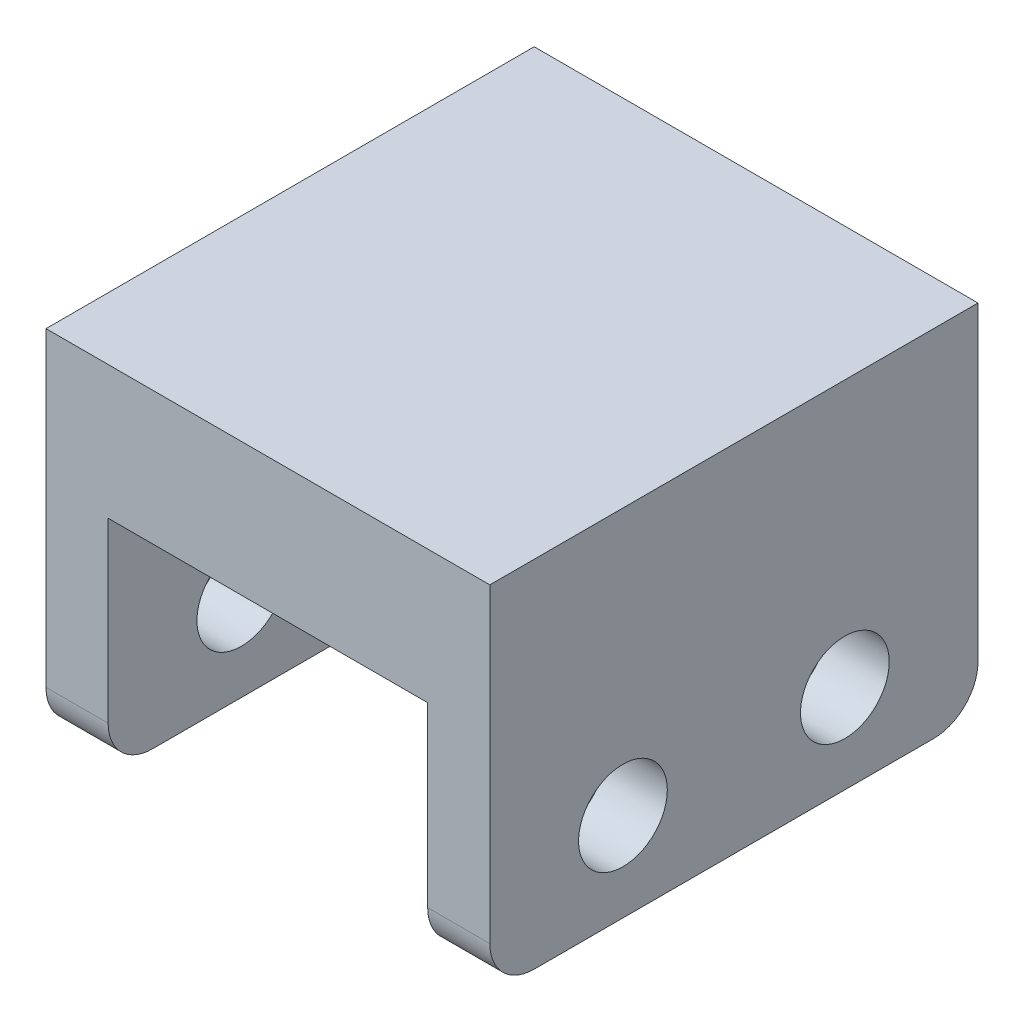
ISO-10303-21;
HEADER;
FILE_DESCRIPTION(('STEP AP214'),'2;1');
FILE_NAME('part.step','',(''),(''),'','','');
FILE_SCHEMA(('AUTOMOTIVE_DESIGN { 1 0 10303 214 1 1 1 1 }'));
ENDSEC;
DATA;
#1=APPLICATION_CONTEXT('core data for automotive mechanical design processes');
#2=APPLICATION_PROTOCOL_DEFINITION('international standard','automotive_design',2000,#1);
#3=PRODUCT_CONTEXT('',#1,'mechanical');
#4=PRODUCT('Part','Part','',(#3));
#5=PRODUCT_RELATED_PRODUCT_CATEGORY('part','',(#4));
#6=PRODUCT_DEFINITION_FORMATION('','',#4);
#7=PRODUCT_DEFINITION_CONTEXT('part definition',#1,'design');
#8=PRODUCT_DEFINITION('design','',#6,#7);
#9=PRODUCT_DEFINITION_SHAPE('','',#8);
#10=(LENGTH_UNIT() NAMED_UNIT(*) SI_UNIT(.MILLI.,.METRE.));
#11=(NAMED_UNIT(*) PLANE_ANGLE_UNIT() SI_UNIT($,.RADIAN.));
#12=(NAMED_UNIT(*) SI_UNIT($,.STERADIAN.) SOLID_ANGLE_UNIT());
#13=UNCERTAINTY_MEASURE_WITH_UNIT(LENGTH_MEASURE(1.E-05),#10,'distance_accuracy_value','');
#14=(GEOMETRIC_REPRESENTATION_CONTEXT(3) GLOBAL_UNCERTAINTY_ASSIGNED_CONTEXT((#13)) GLOBAL_UNIT_ASSIGNED_CONTEXT((#10,
#11,#12)) REPRESENTATION_CONTEXT('',''));
#15=CARTESIAN_POINT('',(0.,0.,0.));
#16=DIRECTION('',(0.,0.,1.));
#17=DIRECTION('',(1.,0.,0.));
#18=AXIS2_PLACEMENT_3D('',#15,#16,#17);
#19=CARTESIAN_POINT('',(0.,0.,0.));
#20=DIRECTION('',(0.,1.,0.));
#21=DIRECTION('',(0.,0.,1.));
#22=AXIS2_PLACEMENT_3D('',#19,#20,#21);
#23=PLANE('',#22);
#24=DIRECTION('',(1.,0.,0.));
#25=VECTOR('',#24,1.);
#26=CARTESIAN_POINT('',(0.,0.,22.5));
#27=LINE('',#26,#25);
#28=CARTESIAN_POINT('',(25.,0.,22.5));
#29=VERTEX_POINT('',#28);
#30=CARTESIAN_POINT('',(18.,0.,22.5));
#31=VERTEX_POINT('',#30);
#32=EDGE_CURVE('E204',#29,#31,#27,.F.);
#33=ORIENTED_EDGE('',*,*,#32,.T.);
#34=DIRECTION('',(0.,0.,1.));
#35=VECTOR('',#34,1.);
#36=CARTESIAN_POINT('',(18.,0.,-27.5));
#37=LINE('',#36,#35);
#38=CARTESIAN_POINT('',(18.,0.,-22.5));
#39=VERTEX_POINT('',#38);
#40=EDGE_CURVE('E154',#39,#31,#37,.T.);
#41=ORIENTED_EDGE('',*,*,#40,.F.);
#42=DIRECTION('',(-1.,0.,0.));
#43=VECTOR('',#42,1.);
#44=CARTESIAN_POINT('',(0.,0.,-22.5));
#45=LINE('',#44,#43);
#46=CARTESIAN_POINT('',(25.,0.,-22.5));
#47=VERTEX_POINT('',#46);
#48=EDGE_CURVE('E207',#39,#47,#45,.F.);
#49=ORIENTED_EDGE('',*,*,#48,.T.);
#50=DIRECTION('',(0.,0.,-1.));
#51=VECTOR('',#50,1.);
#52=CARTESIAN_POINT('',(25.,0.,-27.5));
#53=LINE('',#52,#51);
#54=EDGE_CURVE('E168',#29,#47,#53,.T.);
#55=ORIENTED_EDGE('',*,*,#54,.F.);
#56=EDGE_LOOP('',(#33,#41,#49,#55));
#57=FACE_BOUND('',#56,.T.);
#58=ADVANCED_FACE('F38',(#57),#23,.F.);
#59=CARTESIAN_POINT('',(-25.,5.,-22.5));
#60=DIRECTION('',(-1.,0.,0.));
#61=DIRECTION('',(0.,0.,1.));
#62=AXIS2_PLACEMENT_3D('',#59,#60,#61);
#63=CYLINDRICAL_SURFACE('',#62,5.);
#64=CARTESIAN_POINT('',(18.,5.,-22.5));
#65=DIRECTION('',(1.,0.,0.));
#66=DIRECTION('',(0.,0.,-1.));
#67=AXIS2_PLACEMENT_3D('',#64,#65,#66);
#68=CIRCLE('',#67,5.);
#69=CARTESIAN_POINT('',(18.,5.,-27.5));
#70=VERTEX_POINT('',#69);
#71=EDGE_CURVE('E166',#70,#39,#68,.F.);
#72=ORIENTED_EDGE('',*,*,#71,.F.);
#73=DIRECTION('',(-1.,0.,0.));
#74=VECTOR('',#73,1.);
#75=CARTESIAN_POINT('',(-25.,5.,-27.5));
#76=LINE('',#75,#74);
#77=CARTESIAN_POINT('',(25.,5.,-27.5));
#78=VERTEX_POINT('',#77);
#79=EDGE_CURVE('E196',#78,#70,#76,.T.);
#80=ORIENTED_EDGE('',*,*,#79,.F.);
#81=CARTESIAN_POINT('',(25.,5.,-22.5));
#82=DIRECTION('',(-1.,0.,0.));
#83=DIRECTION('',(0.,0.,1.));
#84=AXIS2_PLACEMENT_3D('',#81,#82,#83);
#85=CIRCLE('',#84,5.);
#86=EDGE_CURVE('E213',#47,#78,#85,.F.);
#87=ORIENTED_EDGE('',*,*,#86,.F.);
#88=ORIENTED_EDGE('',*,*,#48,.F.);
#89=EDGE_LOOP('',(#72,#80,#87,#88));
#90=FACE_BOUND('',#89,.T.);
#91=ADVANCED_FACE('F255',(#90),#63,.T.);
#92=CARTESIAN_POINT('',(-25.,5.,22.5));
#93=DIRECTION('',(1.,0.,0.));
#94=DIRECTION('',(0.,0.,-1.));
#95=AXIS2_PLACEMENT_3D('',#92,#93,#94);
#96=CYLINDRICAL_SURFACE('',#95,5.);
#97=CARTESIAN_POINT('',(18.,5.,22.5));
#98=DIRECTION('',(1.,0.,0.));
#99=DIRECTION('',(0.,0.,-1.));
#100=AXIS2_PLACEMENT_3D('',#97,#98,#99);
#101=CIRCLE('',#100,5.);
#102=CARTESIAN_POINT('',(18.,5.,27.5));
#103=VERTEX_POINT('',#102);
#104=EDGE_CURVE('E12',#31,#103,#101,.F.);
#105=ORIENTED_EDGE('',*,*,#104,.F.);
#106=ORIENTED_EDGE('',*,*,#32,.F.);
#107=CARTESIAN_POINT('',(25.,5.,22.5));
#108=DIRECTION('',(-1.,0.,0.));
#109=DIRECTION('',(0.,0.,1.));
#110=AXIS2_PLACEMENT_3D('',#107,#108,#109);
#111=CIRCLE('',#110,5.);
#112=CARTESIAN_POINT('',(25.,5.,27.5));
#113=VERTEX_POINT('',#112);
#114=EDGE_CURVE('E211',#113,#29,#111,.F.);
#115=ORIENTED_EDGE('',*,*,#114,.F.);
#116=DIRECTION('',(1.,0.,0.));
#117=VECTOR('',#116,1.);
#118=CARTESIAN_POINT('',(-25.,5.,27.5));
#119=LINE('',#118,#117);
#120=EDGE_CURVE('E63',#103,#113,#119,.T.);
#121=ORIENTED_EDGE('',*,*,#120,.F.);
#122=EDGE_LOOP('',(#105,#106,#115,#121));
#123=FACE_BOUND('',#122,.T.);
#124=ADVANCED_FACE('F263',(#123),#96,.T.);
#125=CARTESIAN_POINT('',(25.,40.,-27.5));
#126=DIRECTION('',(-1.,0.,0.));
#127=DIRECTION('',(0.,0.,1.));
#128=AXIS2_PLACEMENT_3D('',#125,#126,#127);
#129=PLANE('',#128);
#130=CARTESIAN_POINT('',(25.,10.,-12.5));
#131=DIRECTION('',(1.,0.,0.));
#132=DIRECTION('',(0.,0.,-1.));
#133=AXIS2_PLACEMENT_3D('',#130,#131,#132);
#134=CIRCLE('',#133,5.);
#135=CARTESIAN_POINT('',(25.,10.,-17.5));
#136=VERTEX_POINT('',#135);
#137=EDGE_CURVE('E336',#136,#136,#134,.T.);
#138=ORIENTED_EDGE('',*,*,#137,.F.);
#139=EDGE_LOOP('',(#138));
#140=FACE_BOUND('',#139,.T.);
#141=CARTESIAN_POINT('',(25.,10.,12.5));
#142=DIRECTION('',(1.,0.,0.));
#143=DIRECTION('',(0.,0.,-1.));
#144=AXIS2_PLACEMENT_3D('',#141,#142,#143);
#145=CIRCLE('',#144,5.);
#146=CARTESIAN_POINT('',(25.,10.,7.49999999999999));
#147=VERTEX_POINT('',#146);
#148=EDGE_CURVE('E220',#147,#147,#145,.T.);
#149=ORIENTED_EDGE('',*,*,#148,.F.);
#150=EDGE_LOOP('',(#149));
#151=FACE_BOUND('',#150,.T.);
#152=ORIENTED_EDGE('',*,*,#54,.T.);
#153=ORIENTED_EDGE('',*,*,#86,.T.);
#154=DIRECTION('',(0.,-1.,0.));
#155=VECTOR('',#154,1.);
#156=CARTESIAN_POINT('',(25.,40.,-27.5));
#157=LINE('',#156,#155);
#158=CARTESIAN_POINT('',(25.,40.,-27.5));
#159=VERTEX_POINT('',#158);
#160=EDGE_CURVE('E192',#159,#78,#157,.T.);
#161=ORIENTED_EDGE('',*,*,#160,.F.);
#162=DIRECTION('',(0.,0.,-1.));
#163=VECTOR('',#162,1.);
#164=CARTESIAN_POINT('',(25.,40.,-27.5));
#165=LINE('',#164,#163);
#166=CARTESIAN_POINT('',(25.,40.,27.5));
#167=VERTEX_POINT('',#166);
#168=EDGE_CURVE('E169',#167,#159,#165,.T.);
#169=ORIENTED_EDGE('',*,*,#168,.F.);
#170=DIRECTION('',(0.,-1.,0.));
#171=VECTOR('',#170,1.);
#172=CARTESIAN_POINT('',(25.,40.,27.5));
#173=LINE('',#172,#171);
#174=EDGE_CURVE('E179',#167,#113,#173,.T.);
#175=ORIENTED_EDGE('',*,*,#174,.T.);
#176=ORIENTED_EDGE('',*,*,#114,.T.);
#177=EDGE_LOOP('',(#152,#153,#161,#169,#175,#176));
#178=FACE_BOUND('',#177,.T.);
#179=ADVANCED_FACE('F295',(#140,#151,#178),#129,.F.);
#180=CARTESIAN_POINT('',(-25.,40.,-27.5));
#181=DIRECTION('',(0.,0.,1.));
#182=DIRECTION('',(1.,0.,0.));
#183=AXIS2_PLACEMENT_3D('',#180,#181,#182);
#184=PLANE('',#183);
#185=ORIENTED_EDGE('',*,*,#79,.T.);
#186=DIRECTION('',(0.,-1.,0.));
#187=VECTOR('',#186,1.);
#188=CARTESIAN_POINT('',(18.,25.,-27.5));
#189=LINE('',#188,#187);
#190=CARTESIAN_POINT('',(18.,25.,-27.5));
#191=VERTEX_POINT('',#190);
#192=EDGE_CURVE('E158',#191,#70,#189,.T.);
#193=ORIENTED_EDGE('',*,*,#192,.F.);
#194=DIRECTION('',(1.,0.,0.));
#195=VECTOR('',#194,1.);
#196=CARTESIAN_POINT('',(-18.,25.,-27.5));
#197=LINE('',#196,#195);
#198=CARTESIAN_POINT('',(-18.,25.,-27.5));
#199=VERTEX_POINT('',#198);
#200=EDGE_CURVE('E135',#199,#191,#197,.T.);
#201=ORIENTED_EDGE('',*,*,#200,.F.);
#202=DIRECTION('',(0.,-1.,0.));
#203=VECTOR('',#202,1.);
#204=CARTESIAN_POINT('',(-18.,25.,-27.5));
#205=LINE('',#204,#203);
#206=CARTESIAN_POINT('',(-18.,5.,-27.5));
#207=VERTEX_POINT('',#206);
#208=EDGE_CURVE('E161',#199,#207,#205,.T.);
#209=ORIENTED_EDGE('',*,*,#208,.T.);
#210=CARTESIAN_POINT('',(-25.,5.,-27.5));
#211=VERTEX_POINT('',#210);
#212=EDGE_CURVE('E195',#207,#211,#76,.T.);
#213=ORIENTED_EDGE('',*,*,#212,.T.);
#214=DIRECTION('',(0.,-1.,0.));
#215=VECTOR('',#214,1.);
#216=CARTESIAN_POINT('',(-25.,40.,-27.5));
#217=LINE('',#216,#215);
#218=CARTESIAN_POINT('',(-25.,40.,-27.5));
#219=VERTEX_POINT('',#218);
#220=EDGE_CURVE('E189',#219,#211,#217,.T.);
#221=ORIENTED_EDGE('',*,*,#220,.F.);
#222=DIRECTION('',(-1.,0.,0.));
#223=VECTOR('',#222,1.);
#224=CARTESIAN_POINT('',(-25.,40.,-27.5));
#225=LINE('',#224,#223);
#226=EDGE_CURVE('E172',#159,#219,#225,.T.);
#227=ORIENTED_EDGE('',*,*,#226,.F.);
#228=ORIENTED_EDGE('',*,*,#160,.T.);
#229=EDGE_LOOP('',(#185,#193,#201,#209,#213,#221,#227,#228));
#230=FACE_BOUND('',#229,.T.);
#231=ADVANCED_FACE('F285',(#230),#184,.F.);
#232=CARTESIAN_POINT('',(-25.,40.,-27.5));
#233=DIRECTION('',(1.,0.,0.));
#234=DIRECTION('',(0.,0.,-1.));
#235=AXIS2_PLACEMENT_3D('',#232,#233,#234);
#236=PLANE('',#235);
#237=CARTESIAN_POINT('',(-25.,10.,-12.5));
#238=DIRECTION('',(1.,0.,0.));
#239=DIRECTION('',(0.,0.,-1.));
#240=AXIS2_PLACEMENT_3D('',#237,#238,#239);
#241=CIRCLE('',#240,5.);
#242=CARTESIAN_POINT('',(-25.,10.,-17.5));
#243=VERTEX_POINT('',#242);
#244=EDGE_CURVE('E226',#243,#243,#241,.T.);
#245=ORIENTED_EDGE('',*,*,#244,.T.);
#246=EDGE_LOOP('',(#245));
#247=FACE_BOUND('',#246,.T.);
#248=CARTESIAN_POINT('',(-25.,10.,12.5));
#249=DIRECTION('',(1.,0.,0.));
#250=DIRECTION('',(0.,0.,-1.));
#251=AXIS2_PLACEMENT_3D('',#248,#249,#250);
#252=CIRCLE('',#251,5.);
#253=CARTESIAN_POINT('',(-25.,10.,7.49999999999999));
#254=VERTEX_POINT('',#253);
#255=EDGE_CURVE('E156',#254,#254,#252,.T.);
#256=ORIENTED_EDGE('',*,*,#255,.T.);
#257=EDGE_LOOP('',(#256));
#258=FACE_BOUND('',#257,.T.);
#259=ORIENTED_EDGE('',*,*,#220,.T.);
#260=CARTESIAN_POINT('',(-25.,5.,-22.5));
#261=DIRECTION('',(1.,0.,0.));
#262=DIRECTION('',(0.,0.,-1.));
#263=AXIS2_PLACEMENT_3D('',#260,#261,#262);
#264=CIRCLE('',#263,5.);
#265=CARTESIAN_POINT('',(-25.,0.,-22.5));
#266=VERTEX_POINT('',#265);
#267=EDGE_CURVE('E201',#211,#266,#264,.F.);
#268=ORIENTED_EDGE('',*,*,#267,.T.);
#269=DIRECTION('',(0.,0.,1.));
#270=VECTOR('',#269,1.);
#271=CARTESIAN_POINT('',(-25.,0.,-27.5));
#272=LINE('',#271,#270);
#273=CARTESIAN_POINT('',(-25.,0.,22.5));
#274=VERTEX_POINT('',#273);
#275=EDGE_CURVE('E173',#266,#274,#272,.T.);
#276=ORIENTED_EDGE('',*,*,#275,.T.);
#277=CARTESIAN_POINT('',(-25.,5.,22.5));
#278=DIRECTION('',(1.,0.,0.));
#279=DIRECTION('',(0.,0.,-1.));
#280=AXIS2_PLACEMENT_3D('',#277,#278,#279);
#281=CIRCLE('',#280,5.);
#282=CARTESIAN_POINT('',(-25.,5.,27.5));
#283=VERTEX_POINT('',#282);
#284=EDGE_CURVE('E199',#274,#283,#281,.F.);
#285=ORIENTED_EDGE('',*,*,#284,.T.);
#286=DIRECTION('',(0.,-1.,0.));
#287=VECTOR('',#286,1.);
#288=CARTESIAN_POINT('',(-25.,40.,27.5));
#289=LINE('',#288,#287);
#290=CARTESIAN_POINT('',(-25.,40.,27.5));
#291=VERTEX_POINT('',#290);
#292=EDGE_CURVE('E186',#291,#283,#289,.T.);
#293=ORIENTED_EDGE('',*,*,#292,.F.);
#294=DIRECTION('',(0.,0.,1.));
#295=VECTOR('',#294,1.);
#296=CARTESIAN_POINT('',(-25.,40.,-27.5));
#297=LINE('',#296,#295);
#298=EDGE_CURVE('E175',#219,#291,#297,.T.);
#299=ORIENTED_EDGE('',*,*,#298,.F.);
#300=EDGE_LOOP('',(#259,#268,#276,#285,#293,#299));
#301=FACE_BOUND('',#300,.T.);
#302=ADVANCED_FACE('F237',(#247,#258,#301),#236,.F.);
#303=CARTESIAN_POINT('',(-25.,40.,27.5));
#304=DIRECTION('',(0.,0.,-1.));
#305=DIRECTION('',(-1.,0.,0.));
#306=AXIS2_PLACEMENT_3D('',#303,#304,#305);
#307=PLANE('',#306);
#308=DIRECTION('',(-1.,0.,0.));
#309=VECTOR('',#308,1.);
#310=CARTESIAN_POINT('',(-18.,25.,27.5));
#311=LINE('',#310,#309);
#312=CARTESIAN_POINT('',(18.,25.,27.5));
#313=VERTEX_POINT('',#312);
#314=CARTESIAN_POINT('',(-18.,25.,27.5));
#315=VERTEX_POINT('',#314);
#316=EDGE_CURVE('E141',#313,#315,#311,.T.);
#317=ORIENTED_EDGE('',*,*,#316,.F.);
#318=DIRECTION('',(0.,-1.,0.));
#319=VECTOR('',#318,1.);
#320=CARTESIAN_POINT('',(18.,25.,27.5));
#321=LINE('',#320,#319);
#322=EDGE_CURVE('E128',#313,#103,#321,.T.);
#323=ORIENTED_EDGE('',*,*,#322,.T.);
#324=ORIENTED_EDGE('',*,*,#120,.T.);
#325=ORIENTED_EDGE('',*,*,#174,.F.);
#326=DIRECTION('',(1.,0.,0.));
#327=VECTOR('',#326,1.);
#328=CARTESIAN_POINT('',(-25.,40.,27.5));
#329=LINE('',#328,#327);
#330=EDGE_CURVE('E177',#291,#167,#329,.T.);
#331=ORIENTED_EDGE('',*,*,#330,.F.);
#332=ORIENTED_EDGE('',*,*,#292,.T.);
#333=CARTESIAN_POINT('',(-18.,5.,27.5));
#334=VERTEX_POINT('',#333);
#335=EDGE_CURVE('E215',#283,#334,#119,.T.);
#336=ORIENTED_EDGE('',*,*,#335,.T.);
#337=DIRECTION('',(0.,-1.,0.));
#338=VECTOR('',#337,1.);
#339=CARTESIAN_POINT('',(-18.,25.,27.5));
#340=LINE('',#339,#338);
#341=EDGE_CURVE('E55',#315,#334,#340,.T.);
#342=ORIENTED_EDGE('',*,*,#341,.F.);
#343=EDGE_LOOP('',(#317,#323,#324,#325,#331,#332,#336,#342));
#344=FACE_BOUND('',#343,.T.);
#345=ADVANCED_FACE('F146',(#344),#307,.F.);
#346=CARTESIAN_POINT('',(0.,40.,0.));
#347=DIRECTION('',(0.,1.,0.));
#348=DIRECTION('',(0.,0.,1.));
#349=AXIS2_PLACEMENT_3D('',#346,#347,#348);
#350=PLANE('',#349);
#351=ORIENTED_EDGE('',*,*,#168,.T.);
#352=ORIENTED_EDGE('',*,*,#226,.T.);
#353=ORIENTED_EDGE('',*,*,#298,.T.);
#354=ORIENTED_EDGE('',*,*,#330,.T.);
#355=EDGE_LOOP('',(#351,#352,#353,#354));
#356=FACE_BOUND('',#355,.T.);
#357=ADVANCED_FACE('F269',(#356),#350,.T.);
#358=CARTESIAN_POINT('',(-18.,0.,-22.5));
#359=VERTEX_POINT('',#358);
#360=EDGE_CURVE('E208',#266,#359,#45,.F.);
#361=ORIENTED_EDGE('',*,*,#360,.T.);
#362=DIRECTION('',(0.,0.,-1.));
#363=VECTOR('',#362,1.);
#364=CARTESIAN_POINT('',(-18.,0.,-27.5));
#365=LINE('',#364,#363);
#366=CARTESIAN_POINT('',(-18.,0.,22.5));
#367=VERTEX_POINT('',#366);
#368=EDGE_CURVE('E144',#367,#359,#365,.T.);
#369=ORIENTED_EDGE('',*,*,#368,.F.);
#370=EDGE_CURVE('E203',#367,#274,#27,.F.);
#371=ORIENTED_EDGE('',*,*,#370,.T.);
#372=ORIENTED_EDGE('',*,*,#275,.F.);
#373=EDGE_LOOP('',(#361,#369,#371,#372));
#374=FACE_BOUND('',#373,.T.);
#375=ADVANCED_FACE('F258',(#374),#23,.F.);
#376=CARTESIAN_POINT('',(-18.,5.,-22.5));
#377=DIRECTION('',(-1.,0.,0.));
#378=DIRECTION('',(0.,0.,1.));
#379=AXIS2_PLACEMENT_3D('',#376,#377,#378);
#380=CIRCLE('',#379,5.);
#381=EDGE_CURVE('E160',#359,#207,#380,.F.);
#382=ORIENTED_EDGE('',*,*,#381,.F.);
#383=ORIENTED_EDGE('',*,*,#360,.F.);
#384=ORIENTED_EDGE('',*,*,#267,.F.);
#385=ORIENTED_EDGE('',*,*,#212,.F.);
#386=EDGE_LOOP('',(#382,#383,#384,#385));
#387=FACE_BOUND('',#386,.T.);
#388=ADVANCED_FACE('F265',(#387),#63,.T.);
#389=CARTESIAN_POINT('',(-18.,5.,22.5));
#390=DIRECTION('',(-1.,0.,0.));
#391=DIRECTION('',(0.,0.,1.));
#392=AXIS2_PLACEMENT_3D('',#389,#390,#391);
#393=CIRCLE('',#392,5.);
#394=EDGE_CURVE('E47',#334,#367,#393,.F.);
#395=ORIENTED_EDGE('',*,*,#394,.F.);
#396=ORIENTED_EDGE('',*,*,#335,.F.);
#397=ORIENTED_EDGE('',*,*,#284,.F.);
#398=ORIENTED_EDGE('',*,*,#370,.F.);
#399=EDGE_LOOP('',(#395,#396,#397,#398));
#400=FACE_BOUND('',#399,.T.);
#401=ADVANCED_FACE('F40',(#400),#96,.T.);
#402=CARTESIAN_POINT('',(18.,25.,-27.5));
#403=DIRECTION('',(1.,0.,0.));
#404=DIRECTION('',(0.,0.,-1.));
#405=AXIS2_PLACEMENT_3D('',#402,#403,#404);
#406=PLANE('',#405);
#407=CARTESIAN_POINT('',(18.,10.,-12.5));
#408=DIRECTION('',(1.,0.,0.));
#409=DIRECTION('',(0.,0.,-1.));
#410=AXIS2_PLACEMENT_3D('',#407,#408,#409);
#411=CIRCLE('',#410,5.);
#412=CARTESIAN_POINT('',(18.,10.,-17.5));
#413=VERTEX_POINT('',#412);
#414=EDGE_CURVE('E231',#413,#413,#411,.T.);
#415=ORIENTED_EDGE('',*,*,#414,.T.);
#416=EDGE_LOOP('',(#415));
#417=FACE_BOUND('',#416,.T.);
#418=CARTESIAN_POINT('',(18.,10.,12.5));
#419=DIRECTION('',(1.,0.,0.));
#420=DIRECTION('',(0.,0.,-1.));
#421=AXIS2_PLACEMENT_3D('',#418,#419,#420);
#422=CIRCLE('',#421,5.);
#423=CARTESIAN_POINT('',(18.,10.,7.49999999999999));
#424=VERTEX_POINT('',#423);
#425=EDGE_CURVE('E219',#424,#424,#422,.T.);
#426=ORIENTED_EDGE('',*,*,#425,.T.);
#427=EDGE_LOOP('',(#426));
#428=FACE_BOUND('',#427,.T.);
#429=ORIENTED_EDGE('',*,*,#71,.T.);
#430=ORIENTED_EDGE('',*,*,#40,.T.);
#431=ORIENTED_EDGE('',*,*,#104,.T.);
#432=ORIENTED_EDGE('',*,*,#322,.F.);
#433=DIRECTION('',(0.,0.,1.));
#434=VECTOR('',#433,1.);
#435=CARTESIAN_POINT('',(18.,25.,-27.5));
#436=LINE('',#435,#434);
#437=EDGE_CURVE('E131',#191,#313,#436,.T.);
#438=ORIENTED_EDGE('',*,*,#437,.F.);
#439=ORIENTED_EDGE('',*,*,#192,.T.);
#440=EDGE_LOOP('',(#429,#430,#431,#432,#438,#439));
#441=FACE_BOUND('',#440,.T.);
#442=ADVANCED_FACE('F130',(#417,#428,#441),#406,.F.);
#443=CARTESIAN_POINT('',(-18.,25.,-27.5));
#444=DIRECTION('',(-1.,0.,0.));
#445=DIRECTION('',(0.,0.,1.));
#446=AXIS2_PLACEMENT_3D('',#443,#444,#445);
#447=PLANE('',#446);
#448=CARTESIAN_POINT('',(-18.,10.,-12.5));
#449=DIRECTION('',(-1.,0.,0.));
#450=DIRECTION('',(0.,0.,1.));
#451=AXIS2_PLACEMENT_3D('',#448,#449,#450);
#452=CIRCLE('',#451,5.);
#453=CARTESIAN_POINT('',(-18.,10.,-17.5));
#454=VERTEX_POINT('',#453);
#455=EDGE_CURVE('E42',#454,#454,#452,.T.);
#456=ORIENTED_EDGE('',*,*,#455,.T.);
#457=EDGE_LOOP('',(#456));
#458=FACE_BOUND('',#457,.T.);
#459=CARTESIAN_POINT('',(-18.,10.,12.5));
#460=DIRECTION('',(-1.,0.,0.));
#461=DIRECTION('',(0.,0.,1.));
#462=AXIS2_PLACEMENT_3D('',#459,#460,#461);
#463=CIRCLE('',#462,5.);
#464=CARTESIAN_POINT('',(-18.,10.,7.49999999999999));
#465=VERTEX_POINT('',#464);
#466=EDGE_CURVE('E217',#465,#465,#463,.T.);
#467=ORIENTED_EDGE('',*,*,#466,.T.);
#468=EDGE_LOOP('',(#467));
#469=FACE_BOUND('',#468,.T.);
#470=ORIENTED_EDGE('',*,*,#381,.T.);
#471=ORIENTED_EDGE('',*,*,#208,.F.);
#472=DIRECTION('',(0.,0.,-1.));
#473=VECTOR('',#472,1.);
#474=CARTESIAN_POINT('',(-18.,25.,-27.5));
#475=LINE('',#474,#473);
#476=EDGE_CURVE('E148',#315,#199,#475,.T.);
#477=ORIENTED_EDGE('',*,*,#476,.F.);
#478=ORIENTED_EDGE('',*,*,#341,.T.);
#479=ORIENTED_EDGE('',*,*,#394,.T.);
#480=ORIENTED_EDGE('',*,*,#368,.T.);
#481=EDGE_LOOP('',(#470,#471,#477,#478,#479,#480));
#482=FACE_BOUND('',#481,.T.);
#483=ADVANCED_FACE('F251',(#458,#469,#482),#447,.F.);
#484=CARTESIAN_POINT('',(0.,25.,0.));
#485=DIRECTION('',(0.,1.,0.));
#486=DIRECTION('',(0.,0.,1.));
#487=AXIS2_PLACEMENT_3D('',#484,#485,#486);
#488=PLANE('',#487);
#489=ORIENTED_EDGE('',*,*,#437,.T.);
#490=ORIENTED_EDGE('',*,*,#316,.T.);
#491=ORIENTED_EDGE('',*,*,#476,.T.);
#492=ORIENTED_EDGE('',*,*,#200,.T.);
#493=EDGE_LOOP('',(#489,#490,#491,#492));
#494=FACE_BOUND('',#493,.T.);
#495=ADVANCED_FACE('F139',(#494),#488,.F.);
#496=CARTESIAN_POINT('',(-36.,10.,12.5));
#497=DIRECTION('',(1.,0.,0.));
#498=DIRECTION('',(0.,0.,-1.));
#499=AXIS2_PLACEMENT_3D('',#496,#497,#498);
#500=CYLINDRICAL_SURFACE('',#499,5.);
#501=CARTESIAN_POINT('',(-18.,10.,7.49999999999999));
#502=CARTESIAN_POINT('',(-18.0729166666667,10.,7.49999999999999));
#503=CARTESIAN_POINT('',(-18.1458333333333,10.,7.49999999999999));
#504=CARTESIAN_POINT('',(-18.2916666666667,10.,7.49999999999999));
#505=CARTESIAN_POINT('',(-18.3645833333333,10.,7.49999999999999));
#506=CARTESIAN_POINT('',(-18.5104166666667,10.,7.49999999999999));
#507=CARTESIAN_POINT('',(-18.5833333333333,10.,7.49999999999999));
#508=CARTESIAN_POINT('',(-18.7291666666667,10.,7.49999999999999));
#509=CARTESIAN_POINT('',(-18.8020833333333,10.,7.49999999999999));
#510=CARTESIAN_POINT('',(-18.9479166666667,10.,7.49999999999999));
#511=CARTESIAN_POINT('',(-19.0208333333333,10.,7.49999999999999));
#512=CARTESIAN_POINT('',(-19.1666666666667,10.,7.49999999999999));
#513=CARTESIAN_POINT('',(-19.2395833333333,10.,7.49999999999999));
#514=CARTESIAN_POINT('',(-19.3854166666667,10.,7.49999999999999));
#515=CARTESIAN_POINT('',(-19.4583333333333,10.,7.49999999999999));
#516=CARTESIAN_POINT('',(-19.6041666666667,10.,7.49999999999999));
#517=CARTESIAN_POINT('',(-19.6770833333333,10.,7.49999999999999));
#518=CARTESIAN_POINT('',(-19.8229166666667,10.,7.49999999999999));
#519=CARTESIAN_POINT('',(-19.8958333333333,10.,7.49999999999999));
#520=CARTESIAN_POINT('',(-20.0416666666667,10.,7.49999999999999));
#521=CARTESIAN_POINT('',(-20.1145833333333,10.,7.49999999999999));
#522=CARTESIAN_POINT('',(-20.2604166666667,10.,7.49999999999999));
#523=CARTESIAN_POINT('',(-20.3333333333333,10.,7.49999999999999));
#524=CARTESIAN_POINT('',(-20.4791666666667,10.,7.49999999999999));
#525=CARTESIAN_POINT('',(-20.5520833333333,10.,7.49999999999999));
#526=CARTESIAN_POINT('',(-20.6979166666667,10.,7.49999999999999));
#527=CARTESIAN_POINT('',(-20.7708333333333,10.,7.49999999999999));
#528=CARTESIAN_POINT('',(-20.9166666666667,10.,7.49999999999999));
#529=CARTESIAN_POINT('',(-20.9895833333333,10.,7.49999999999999));
#530=CARTESIAN_POINT('',(-21.1354166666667,10.,7.49999999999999));
#531=CARTESIAN_POINT('',(-21.2083333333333,10.,7.49999999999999));
#532=CARTESIAN_POINT('',(-21.3541666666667,10.,7.49999999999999));
#533=CARTESIAN_POINT('',(-21.4270833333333,10.,7.49999999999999));
#534=CARTESIAN_POINT('',(-21.5729166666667,10.,7.49999999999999));
#535=CARTESIAN_POINT('',(-21.6458333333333,10.,7.49999999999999));
#536=CARTESIAN_POINT('',(-21.7916666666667,10.,7.49999999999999));
#537=CARTESIAN_POINT('',(-21.8645833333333,10.,7.49999999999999));
#538=CARTESIAN_POINT('',(-22.0104166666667,10.,7.49999999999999));
#539=CARTESIAN_POINT('',(-22.0833333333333,10.,7.49999999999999));
#540=CARTESIAN_POINT('',(-22.2291666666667,10.,7.49999999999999));
#541=CARTESIAN_POINT('',(-22.3020833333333,10.,7.49999999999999));
#542=CARTESIAN_POINT('',(-22.4479166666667,10.,7.49999999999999));
#543=CARTESIAN_POINT('',(-22.5208333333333,10.,7.49999999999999));
#544=CARTESIAN_POINT('',(-22.6666666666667,10.,7.49999999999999));
#545=CARTESIAN_POINT('',(-22.7395833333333,10.,7.49999999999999));
#546=CARTESIAN_POINT('',(-22.8854166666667,10.,7.49999999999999));
#547=CARTESIAN_POINT('',(-22.9583333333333,10.,7.49999999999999));
#548=CARTESIAN_POINT('',(-23.1041666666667,10.,7.49999999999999));
#549=CARTESIAN_POINT('',(-23.1770833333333,10.,7.49999999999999));
#550=CARTESIAN_POINT('',(-23.3229166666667,10.,7.49999999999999));
#551=CARTESIAN_POINT('',(-23.3958333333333,10.,7.49999999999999));
#552=CARTESIAN_POINT('',(-23.5416666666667,10.,7.49999999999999));
#553=CARTESIAN_POINT('',(-23.6145833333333,10.,7.49999999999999));
#554=CARTESIAN_POINT('',(-23.7604166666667,10.,7.49999999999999));
#555=CARTESIAN_POINT('',(-23.8333333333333,10.,7.49999999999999));
#556=CARTESIAN_POINT('',(-23.9791666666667,10.,7.49999999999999));
#557=CARTESIAN_POINT('',(-24.0520833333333,10.,7.49999999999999));
#558=CARTESIAN_POINT('',(-24.1979166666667,10.,7.49999999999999));
#559=CARTESIAN_POINT('',(-24.2708333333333,10.,7.49999999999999));
#560=CARTESIAN_POINT('',(-24.4166666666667,10.,7.49999999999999));
#561=CARTESIAN_POINT('',(-24.4895833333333,10.,7.49999999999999));
#562=CARTESIAN_POINT('',(-24.6354166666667,10.,7.49999999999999));
#563=CARTESIAN_POINT('',(-24.7083333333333,10.,7.49999999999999));
#564=CARTESIAN_POINT('',(-24.8541666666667,10.,7.49999999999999));
#565=CARTESIAN_POINT('',(-24.9270833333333,10.,7.49999999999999));
#566=CARTESIAN_POINT('',(-25.,10.,7.49999999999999));
#567=B_SPLINE_CURVE_WITH_KNOTS('',3,(#501,#502,#503,#504,#505,#506,#507,#508,#509,#510,#511,
#512,#513,#514,#515,#516,#517,#518,#519,#520,#521,#522,#523,#524,#525,#526,#527,#528,#529,#530,
#531,#532,#533,#534,#535,#536,#537,#538,#539,#540,#541,#542,#543,#544,#545,#546,#547,#548,#549,
#550,#551,#552,#553,#554,#555,#556,#557,#558,#559,#560,#561,#562,#563,#564,#565,#566),
.UNSPECIFIED.,.F.,.F.,(4,2,2,2,2,2,2,2,2,2,2,2,2,2,2,2,2,2,2,2,2,2,2,2,2,2,2,2,2,2,2,2,4),(0.,
0.21875,0.4375,0.656250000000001,0.875000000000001,1.09375,1.3125,1.53125,1.75,1.96875,2.1875,
2.40625,2.625,2.84375,3.0625,3.28125,3.5,3.71875,3.9375,4.15625,4.375,4.59375,4.8125,5.03125,
5.25,5.46875,5.6875,5.90625000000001,6.125,6.34375000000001,6.5625,6.78125000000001,7.),.UNSPECIFIED.);
#568=EDGE_CURVE('BSEAM240',#465,#254,#567,.T.);
#569=ORIENTED_EDGE('',*,*,#466,.F.);
#570=ORIENTED_EDGE('',*,*,#255,.F.);
#571=ORIENTED_EDGE('',*,*,#568,.T.);
#572=ORIENTED_EDGE('',*,*,#568,.F.);
#573=EDGE_LOOP('',(#569,#571,#570,#572));
#574=FACE_BOUND('',#573,.T.);
#575=ADVANCED_FACE('F240',(#574),#500,.F.);
#576=CARTESIAN_POINT('',(25.,10.,7.49999999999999));
#577=CARTESIAN_POINT('',(24.9270833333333,10.,7.49999999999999));
#578=CARTESIAN_POINT('',(24.8541666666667,10.,7.49999999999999));
#579=CARTESIAN_POINT('',(24.7083333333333,10.,7.49999999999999));
#580=CARTESIAN_POINT('',(24.6354166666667,10.,7.49999999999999));
#581=CARTESIAN_POINT('',(24.4895833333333,10.,7.49999999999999));
#582=CARTESIAN_POINT('',(24.4166666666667,10.,7.49999999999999));
#583=CARTESIAN_POINT('',(24.2708333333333,10.,7.49999999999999));
#584=CARTESIAN_POINT('',(24.1979166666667,10.,7.49999999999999));
#585=CARTESIAN_POINT('',(24.0520833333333,10.,7.49999999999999));
#586=CARTESIAN_POINT('',(23.9791666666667,10.,7.49999999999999));
#587=CARTESIAN_POINT('',(23.8333333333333,10.,7.49999999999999));
#588=CARTESIAN_POINT('',(23.7604166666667,10.,7.49999999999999));
#589=CARTESIAN_POINT('',(23.6145833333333,10.,7.49999999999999));
#590=CARTESIAN_POINT('',(23.5416666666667,10.,7.49999999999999));
#591=CARTESIAN_POINT('',(23.3958333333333,10.,7.49999999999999));
#592=CARTESIAN_POINT('',(23.3229166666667,10.,7.49999999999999));
#593=CARTESIAN_POINT('',(23.1770833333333,10.,7.49999999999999));
#594=CARTESIAN_POINT('',(23.1041666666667,10.,7.49999999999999));
#595=CARTESIAN_POINT('',(22.9583333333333,10.,7.49999999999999));
#596=CARTESIAN_POINT('',(22.8854166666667,10.,7.49999999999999));
#597=CARTESIAN_POINT('',(22.7395833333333,10.,7.49999999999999));
#598=CARTESIAN_POINT('',(22.6666666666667,10.,7.49999999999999));
#599=CARTESIAN_POINT('',(22.5208333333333,10.,7.49999999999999));
#600=CARTESIAN_POINT('',(22.4479166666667,10.,7.49999999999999));
#601=CARTESIAN_POINT('',(22.3020833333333,10.,7.49999999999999));
#602=CARTESIAN_POINT('',(22.2291666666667,10.,7.49999999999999));
#603=CARTESIAN_POINT('',(22.0833333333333,10.,7.49999999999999));
#604=CARTESIAN_POINT('',(22.0104166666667,10.,7.49999999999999));
#605=CARTESIAN_POINT('',(21.8645833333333,10.,7.49999999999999));
#606=CARTESIAN_POINT('',(21.7916666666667,10.,7.49999999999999));
#607=CARTESIAN_POINT('',(21.6458333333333,10.,7.49999999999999));
#608=CARTESIAN_POINT('',(21.5729166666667,10.,7.49999999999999));
#609=CARTESIAN_POINT('',(21.4270833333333,10.,7.49999999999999));
#610=CARTESIAN_POINT('',(21.3541666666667,10.,7.49999999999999));
#611=CARTESIAN_POINT('',(21.2083333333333,10.,7.49999999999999));
#612=CARTESIAN_POINT('',(21.1354166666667,10.,7.49999999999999));
#613=CARTESIAN_POINT('',(20.9895833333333,10.,7.49999999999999));
#614=CARTESIAN_POINT('',(20.9166666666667,10.,7.49999999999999));
#615=CARTESIAN_POINT('',(20.7708333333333,10.,7.49999999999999));
#616=CARTESIAN_POINT('',(20.6979166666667,10.,7.49999999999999));
#617=CARTESIAN_POINT('',(20.5520833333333,10.,7.49999999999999));
#618=CARTESIAN_POINT('',(20.4791666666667,10.,7.49999999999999));
#619=CARTESIAN_POINT('',(20.3333333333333,10.,7.49999999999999));
#620=CARTESIAN_POINT('',(20.2604166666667,10.,7.49999999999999));
#621=CARTESIAN_POINT('',(20.1145833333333,10.,7.49999999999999));
#622=CARTESIAN_POINT('',(20.0416666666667,10.,7.49999999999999));
#623=CARTESIAN_POINT('',(19.8958333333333,10.,7.49999999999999));
#624=CARTESIAN_POINT('',(19.8229166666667,10.,7.49999999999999));
#625=CARTESIAN_POINT('',(19.6770833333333,10.,7.49999999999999));
#626=CARTESIAN_POINT('',(19.6041666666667,10.,7.49999999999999));
#627=CARTESIAN_POINT('',(19.4583333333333,10.,7.49999999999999));
#628=CARTESIAN_POINT('',(19.3854166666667,10.,7.49999999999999));
#629=CARTESIAN_POINT('',(19.2395833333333,10.,7.49999999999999));
#630=CARTESIAN_POINT('',(19.1666666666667,10.,7.49999999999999));
#631=CARTESIAN_POINT('',(19.0208333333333,10.,7.49999999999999));
#632=CARTESIAN_POINT('',(18.9479166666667,10.,7.49999999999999));
#633=CARTESIAN_POINT('',(18.8020833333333,10.,7.49999999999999));
#634=CARTESIAN_POINT('',(18.7291666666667,10.,7.49999999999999));
#635=CARTESIAN_POINT('',(18.5833333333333,10.,7.49999999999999));
#636=CARTESIAN_POINT('',(18.5104166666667,10.,7.49999999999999));
#637=CARTESIAN_POINT('',(18.3645833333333,10.,7.49999999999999));
#638=CARTESIAN_POINT('',(18.2916666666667,10.,7.49999999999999));
#639=CARTESIAN_POINT('',(18.1458333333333,10.,7.49999999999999));
#640=CARTESIAN_POINT('',(18.0729166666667,10.,7.49999999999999));
#641=CARTESIAN_POINT('',(18.,10.,7.49999999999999));
#642=B_SPLINE_CURVE_WITH_KNOTS('',3,(#576,#577,#578,#579,#580,#581,#582,#583,#584,#585,#586,
#587,#588,#589,#590,#591,#592,#593,#594,#595,#596,#597,#598,#599,#600,#601,#602,#603,#604,#605,
#606,#607,#608,#609,#610,#611,#612,#613,#614,#615,#616,#617,#618,#619,#620,#621,#622,#623,#624,
#625,#626,#627,#628,#629,#630,#631,#632,#633,#634,#635,#636,#637,#638,#639,#640,#641),
.UNSPECIFIED.,.F.,.F.,(4,2,2,2,2,2,2,2,2,2,2,2,2,2,2,2,2,2,2,2,2,2,2,2,2,2,2,2,2,2,2,2,4),(0.,
0.218750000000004,0.4375,0.656249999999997,0.875000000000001,1.09375,1.3125,1.53125,1.75,
1.96875000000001,2.1875,2.40625,2.625,2.84375000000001,3.0625,3.28125,3.5,3.71875000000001,
3.9375,4.15625,4.375,4.59375000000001,4.8125,5.03125,5.25,5.46875000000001,5.68750000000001,
5.90625,6.12500000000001,6.34375000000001,6.56250000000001,6.78125,7.00000000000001),.UNSPECIFIED.);
#643=EDGE_CURVE('BSEAM242',#147,#424,#642,.T.);
#644=ORIENTED_EDGE('',*,*,#148,.T.);
#645=ORIENTED_EDGE('',*,*,#425,.F.);
#646=ORIENTED_EDGE('',*,*,#643,.T.);
#647=ORIENTED_EDGE('',*,*,#643,.F.);
#648=EDGE_LOOP('',(#644,#646,#645,#647));
#649=FACE_BOUND('',#648,.T.);
#650=ADVANCED_FACE('F242',(#649),#500,.F.);
#651=CARTESIAN_POINT('',(-36.,10.,-12.5));
#652=DIRECTION('',(1.,0.,0.));
#653=DIRECTION('',(0.,0.,-1.));
#654=AXIS2_PLACEMENT_3D('',#651,#652,#653);
#655=CYLINDRICAL_SURFACE('',#654,5.);
#656=CARTESIAN_POINT('',(-18.,10.,-17.5));
#657=CARTESIAN_POINT('',(-18.0729166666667,10.,-17.5));
#658=CARTESIAN_POINT('',(-18.1458333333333,10.,-17.5));
#659=CARTESIAN_POINT('',(-18.2916666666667,10.,-17.5));
#660=CARTESIAN_POINT('',(-18.3645833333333,10.,-17.5));
#661=CARTESIAN_POINT('',(-18.5104166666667,10.,-17.5));
#662=CARTESIAN_POINT('',(-18.5833333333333,10.,-17.5));
#663=CARTESIAN_POINT('',(-18.7291666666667,10.,-17.5));
#664=CARTESIAN_POINT('',(-18.8020833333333,10.,-17.5));
#665=CARTESIAN_POINT('',(-18.9479166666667,10.,-17.5));
#666=CARTESIAN_POINT('',(-19.0208333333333,10.,-17.5));
#667=CARTESIAN_POINT('',(-19.1666666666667,10.,-17.5));
#668=CARTESIAN_POINT('',(-19.2395833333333,10.,-17.5));
#669=CARTESIAN_POINT('',(-19.3854166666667,10.,-17.5));
#670=CARTESIAN_POINT('',(-19.4583333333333,10.,-17.5));
#671=CARTESIAN_POINT('',(-19.6041666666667,10.,-17.5));
#672=CARTESIAN_POINT('',(-19.6770833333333,10.,-17.5));
#673=CARTESIAN_POINT('',(-19.8229166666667,10.,-17.5));
#674=CARTESIAN_POINT('',(-19.8958333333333,10.,-17.5));
#675=CARTESIAN_POINT('',(-20.0416666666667,10.,-17.5));
#676=CARTESIAN_POINT('',(-20.1145833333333,10.,-17.5));
#677=CARTESIAN_POINT('',(-20.2604166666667,10.,-17.5));
#678=CARTESIAN_POINT('',(-20.3333333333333,10.,-17.5));
#679=CARTESIAN_POINT('',(-20.4791666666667,10.,-17.5));
#680=CARTESIAN_POINT('',(-20.5520833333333,10.,-17.5));
#681=CARTESIAN_POINT('',(-20.6979166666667,10.,-17.5));
#682=CARTESIAN_POINT('',(-20.7708333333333,10.,-17.5));
#683=CARTESIAN_POINT('',(-20.9166666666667,10.,-17.5));
#684=CARTESIAN_POINT('',(-20.9895833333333,10.,-17.5));
#685=CARTESIAN_POINT('',(-21.1354166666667,10.,-17.5));
#686=CARTESIAN_POINT('',(-21.2083333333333,10.,-17.5));
#687=CARTESIAN_POINT('',(-21.3541666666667,10.,-17.5));
#688=CARTESIAN_POINT('',(-21.4270833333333,10.,-17.5));
#689=CARTESIAN_POINT('',(-21.5729166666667,10.,-17.5));
#690=CARTESIAN_POINT('',(-21.6458333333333,10.,-17.5));
#691=CARTESIAN_POINT('',(-21.7916666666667,10.,-17.5));
#692=CARTESIAN_POINT('',(-21.8645833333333,10.,-17.5));
#693=CARTESIAN_POINT('',(-22.0104166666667,10.,-17.5));
#694=CARTESIAN_POINT('',(-22.0833333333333,10.,-17.5));
#695=CARTESIAN_POINT('',(-22.2291666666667,10.,-17.5));
#696=CARTESIAN_POINT('',(-22.3020833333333,10.,-17.5));
#697=CARTESIAN_POINT('',(-22.4479166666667,10.,-17.5));
#698=CARTESIAN_POINT('',(-22.5208333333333,10.,-17.5));
#699=CARTESIAN_POINT('',(-22.6666666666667,10.,-17.5));
#700=CARTESIAN_POINT('',(-22.7395833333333,10.,-17.5));
#701=CARTESIAN_POINT('',(-22.8854166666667,10.,-17.5));
#702=CARTESIAN_POINT('',(-22.9583333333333,10.,-17.5));
#703=CARTESIAN_POINT('',(-23.1041666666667,10.,-17.5));
#704=CARTESIAN_POINT('',(-23.1770833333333,10.,-17.5));
#705=CARTESIAN_POINT('',(-23.3229166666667,10.,-17.5));
#706=CARTESIAN_POINT('',(-23.3958333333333,10.,-17.5));
#707=CARTESIAN_POINT('',(-23.5416666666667,10.,-17.5));
#708=CARTESIAN_POINT('',(-23.6145833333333,10.,-17.5));
#709=CARTESIAN_POINT('',(-23.7604166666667,10.,-17.5));
#710=CARTESIAN_POINT('',(-23.8333333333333,10.,-17.5));
#711=CARTESIAN_POINT('',(-23.9791666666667,10.,-17.5));
#712=CARTESIAN_POINT('',(-24.0520833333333,10.,-17.5));
#713=CARTESIAN_POINT('',(-24.1979166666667,10.,-17.5));
#714=CARTESIAN_POINT('',(-24.2708333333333,10.,-17.5));
#715=CARTESIAN_POINT('',(-24.4166666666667,10.,-17.5));
#716=CARTESIAN_POINT('',(-24.4895833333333,10.,-17.5));
#717=CARTESIAN_POINT('',(-24.6354166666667,10.,-17.5));
#718=CARTESIAN_POINT('',(-24.7083333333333,10.,-17.5));
#719=CARTESIAN_POINT('',(-24.8541666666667,10.,-17.5));
#720=CARTESIAN_POINT('',(-24.9270833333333,10.,-17.5));
#721=CARTESIAN_POINT('',(-25.,10.,-17.5));
#722=B_SPLINE_CURVE_WITH_KNOTS('',3,(#656,#657,#658,#659,#660,#661,#662,#663,#664,#665,#666,
#667,#668,#669,#670,#671,#672,#673,#674,#675,#676,#677,#678,#679,#680,#681,#682,#683,#684,#685,
#686,#687,#688,#689,#690,#691,#692,#693,#694,#695,#696,#697,#698,#699,#700,#701,#702,#703,#704,
#705,#706,#707,#708,#709,#710,#711,#712,#713,#714,#715,#716,#717,#718,#719,#720,#721),
.UNSPECIFIED.,.F.,.F.,(4,2,2,2,2,2,2,2,2,2,2,2,2,2,2,2,2,2,2,2,2,2,2,2,2,2,2,2,2,2,2,2,4),(0.,
0.21875,0.4375,0.656250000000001,0.875000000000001,1.09375,1.3125,1.53125,1.75,1.96875,2.1875,
2.40625,2.625,2.84375,3.0625,3.28125,3.5,3.71875,3.9375,4.15625,4.375,4.59375,4.8125,5.03125,
5.25,5.46875,5.6875,5.90625000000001,6.125,6.34375000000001,6.5625,6.78125000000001,7.),.UNSPECIFIED.);
#723=EDGE_CURVE('BSEAM249',#454,#243,#722,.T.);
#724=ORIENTED_EDGE('',*,*,#455,.F.);
#725=ORIENTED_EDGE('',*,*,#244,.F.);
#726=ORIENTED_EDGE('',*,*,#723,.T.);
#727=ORIENTED_EDGE('',*,*,#723,.F.);
#728=EDGE_LOOP('',(#724,#726,#725,#727));
#729=FACE_BOUND('',#728,.T.);
#730=ADVANCED_FACE('F249',(#729),#655,.F.);
#731=CARTESIAN_POINT('',(25.,10.,-17.5));
#732=CARTESIAN_POINT('',(24.9270833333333,10.,-17.5));
#733=CARTESIAN_POINT('',(24.8541666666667,10.,-17.5));
#734=CARTESIAN_POINT('',(24.7083333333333,10.,-17.5));
#735=CARTESIAN_POINT('',(24.6354166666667,10.,-17.5));
#736=CARTESIAN_POINT('',(24.4895833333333,10.,-17.5));
#737=CARTESIAN_POINT('',(24.4166666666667,10.,-17.5));
#738=CARTESIAN_POINT('',(24.2708333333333,10.,-17.5));
#739=CARTESIAN_POINT('',(24.1979166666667,10.,-17.5));
#740=CARTESIAN_POINT('',(24.0520833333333,10.,-17.5));
#741=CARTESIAN_POINT('',(23.9791666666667,10.,-17.5));
#742=CARTESIAN_POINT('',(23.8333333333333,10.,-17.5));
#743=CARTESIAN_POINT('',(23.7604166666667,10.,-17.5));
#744=CARTESIAN_POINT('',(23.6145833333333,10.,-17.5));
#745=CARTESIAN_POINT('',(23.5416666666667,10.,-17.5));
#746=CARTESIAN_POINT('',(23.3958333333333,10.,-17.5));
#747=CARTESIAN_POINT('',(23.3229166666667,10.,-17.5));
#748=CARTESIAN_POINT('',(23.1770833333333,10.,-17.5));
#749=CARTESIAN_POINT('',(23.1041666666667,10.,-17.5));
#750=CARTESIAN_POINT('',(22.9583333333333,10.,-17.5));
#751=CARTESIAN_POINT('',(22.8854166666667,10.,-17.5));
#752=CARTESIAN_POINT('',(22.7395833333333,10.,-17.5));
#753=CARTESIAN_POINT('',(22.6666666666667,10.,-17.5));
#754=CARTESIAN_POINT('',(22.5208333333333,10.,-17.5));
#755=CARTESIAN_POINT('',(22.4479166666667,10.,-17.5));
#756=CARTESIAN_POINT('',(22.3020833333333,10.,-17.5));
#757=CARTESIAN_POINT('',(22.2291666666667,10.,-17.5));
#758=CARTESIAN_POINT('',(22.0833333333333,10.,-17.5));
#759=CARTESIAN_POINT('',(22.0104166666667,10.,-17.5));
#760=CARTESIAN_POINT('',(21.8645833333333,10.,-17.5));
#761=CARTESIAN_POINT('',(21.7916666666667,10.,-17.5));
#762=CARTESIAN_POINT('',(21.6458333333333,10.,-17.5));
#763=CARTESIAN_POINT('',(21.5729166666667,10.,-17.5));
#764=CARTESIAN_POINT('',(21.4270833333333,10.,-17.5));
#765=CARTESIAN_POINT('',(21.3541666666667,10.,-17.5));
#766=CARTESIAN_POINT('',(21.2083333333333,10.,-17.5));
#767=CARTESIAN_POINT('',(21.1354166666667,10.,-17.5));
#768=CARTESIAN_POINT('',(20.9895833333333,10.,-17.5));
#769=CARTESIAN_POINT('',(20.9166666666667,10.,-17.5));
#770=CARTESIAN_POINT('',(20.7708333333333,10.,-17.5));
#771=CARTESIAN_POINT('',(20.6979166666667,10.,-17.5));
#772=CARTESIAN_POINT('',(20.5520833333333,10.,-17.5));
#773=CARTESIAN_POINT('',(20.4791666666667,10.,-17.5));
#774=CARTESIAN_POINT('',(20.3333333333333,10.,-17.5));
#775=CARTESIAN_POINT('',(20.2604166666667,10.,-17.5));
#776=CARTESIAN_POINT('',(20.1145833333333,10.,-17.5));
#777=CARTESIAN_POINT('',(20.0416666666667,10.,-17.5));
#778=CARTESIAN_POINT('',(19.8958333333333,10.,-17.5));
#779=CARTESIAN_POINT('',(19.8229166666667,10.,-17.5));
#780=CARTESIAN_POINT('',(19.6770833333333,10.,-17.5));
#781=CARTESIAN_POINT('',(19.6041666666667,10.,-17.5));
#782=CARTESIAN_POINT('',(19.4583333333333,10.,-17.5));
#783=CARTESIAN_POINT('',(19.3854166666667,10.,-17.5));
#784=CARTESIAN_POINT('',(19.2395833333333,10.,-17.5));
#785=CARTESIAN_POINT('',(19.1666666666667,10.,-17.5));
#786=CARTESIAN_POINT('',(19.0208333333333,10.,-17.5));
#787=CARTESIAN_POINT('',(18.9479166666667,10.,-17.5));
#788=CARTESIAN_POINT('',(18.8020833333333,10.,-17.5));
#789=CARTESIAN_POINT('',(18.7291666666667,10.,-17.5));
#790=CARTESIAN_POINT('',(18.5833333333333,10.,-17.5));
#791=CARTESIAN_POINT('',(18.5104166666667,10.,-17.5));
#792=CARTESIAN_POINT('',(18.3645833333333,10.,-17.5));
#793=CARTESIAN_POINT('',(18.2916666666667,10.,-17.5));
#794=CARTESIAN_POINT('',(18.1458333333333,10.,-17.5));
#795=CARTESIAN_POINT('',(18.0729166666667,10.,-17.5));
#796=CARTESIAN_POINT('',(18.,10.,-17.5));
#797=B_SPLINE_CURVE_WITH_KNOTS('',3,(#731,#732,#733,#734,#735,#736,#737,#738,#739,#740,#741,
#742,#743,#744,#745,#746,#747,#748,#749,#750,#751,#752,#753,#754,#755,#756,#757,#758,#759,#760,
#761,#762,#763,#764,#765,#766,#767,#768,#769,#770,#771,#772,#773,#774,#775,#776,#777,#778,#779,
#780,#781,#782,#783,#784,#785,#786,#787,#788,#789,#790,#791,#792,#793,#794,#795,#796),
.UNSPECIFIED.,.F.,.F.,(4,2,2,2,2,2,2,2,2,2,2,2,2,2,2,2,2,2,2,2,2,2,2,2,2,2,2,2,2,2,2,2,4),(0.,
0.218750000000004,0.4375,0.656249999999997,0.875000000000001,1.09375,1.3125,1.53125,1.75,
1.96875000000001,2.1875,2.40625,2.625,2.84375000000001,3.0625,3.28125,3.5,3.71875000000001,
3.9375,4.15625,4.375,4.59375000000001,4.8125,5.03125,5.25,5.46875000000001,5.68750000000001,
5.90625,6.12500000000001,6.34375000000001,6.56250000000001,6.78125,7.00000000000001),.UNSPECIFIED.);
#798=EDGE_CURVE('BSEAM327',#136,#413,#797,.T.);
#799=ORIENTED_EDGE('',*,*,#137,.T.);
#800=ORIENTED_EDGE('',*,*,#414,.F.);
#801=ORIENTED_EDGE('',*,*,#798,.T.);
#802=ORIENTED_EDGE('',*,*,#798,.F.);
#803=EDGE_LOOP('',(#799,#801,#800,#802));
#804=FACE_BOUND('',#803,.T.);
#805=ADVANCED_FACE('F327',(#804),#655,.F.);
#806=CLOSED_SHELL('',(#58,#91,#124,#179,#231,#302,#345,#357,#375,#388,#401,#442,#483,#495,#575,
#650,#730,#805));
#807=MANIFOLD_SOLID_BREP('B2',#806);
#808=ADVANCED_BREP_SHAPE_REPRESENTATION('',(#18,#807),#14);
#809=SHAPE_DEFINITION_REPRESENTATION(#9,#808);
ENDSEC;
END-ISO-10303-21;
